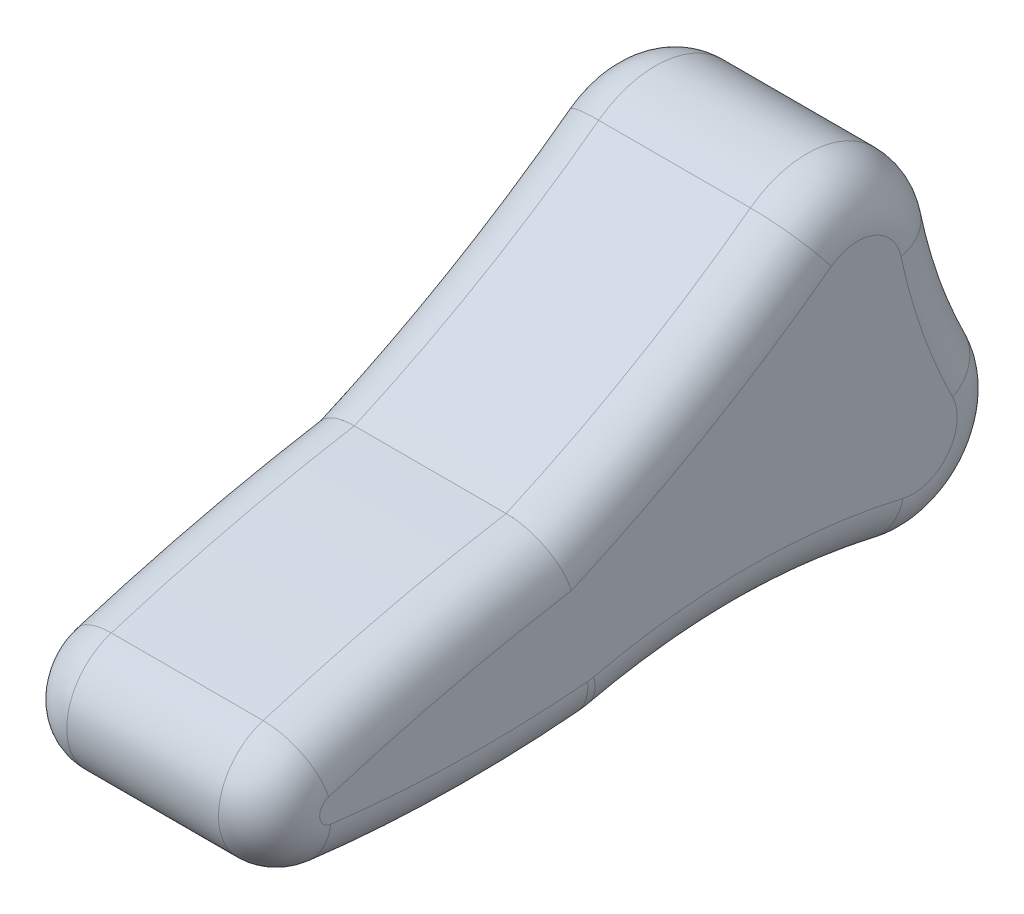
ISO-10303-21;
HEADER;
FILE_DESCRIPTION(('STEP AP214'),'2;1');
FILE_NAME('part.step','',(''),(''),'','','');
FILE_SCHEMA(('AUTOMOTIVE_DESIGN { 1 0 10303 214 1 1 1 1 }'));
ENDSEC;
DATA;
#1=APPLICATION_CONTEXT('core data for automotive mechanical design processes');
#2=APPLICATION_PROTOCOL_DEFINITION('international standard','automotive_design',2000,#1);
#3=PRODUCT_CONTEXT('',#1,'mechanical');
#4=PRODUCT('Part','Part','',(#3));
#5=PRODUCT_RELATED_PRODUCT_CATEGORY('part','',(#4));
#6=PRODUCT_DEFINITION_FORMATION('','',#4);
#7=PRODUCT_DEFINITION_CONTEXT('part definition',#1,'design');
#8=PRODUCT_DEFINITION('design','',#6,#7);
#9=PRODUCT_DEFINITION_SHAPE('','',#8);
#10=(LENGTH_UNIT() NAMED_UNIT(*) SI_UNIT(.MILLI.,.METRE.));
#11=(NAMED_UNIT(*) PLANE_ANGLE_UNIT() SI_UNIT($,.RADIAN.));
#12=(NAMED_UNIT(*) SI_UNIT($,.STERADIAN.) SOLID_ANGLE_UNIT());
#13=UNCERTAINTY_MEASURE_WITH_UNIT(LENGTH_MEASURE(1.E-05),#10,'distance_accuracy_value','');
#14=(GEOMETRIC_REPRESENTATION_CONTEXT(3) GLOBAL_UNCERTAINTY_ASSIGNED_CONTEXT((#13)) GLOBAL_UNIT_ASSIGNED_CONTEXT((#10,
#11,#12)) REPRESENTATION_CONTEXT('',''));
#15=CARTESIAN_POINT('',(0.,0.,0.));
#16=DIRECTION('',(0.,0.,1.));
#17=DIRECTION('',(1.,0.,0.));
#18=AXIS2_PLACEMENT_3D('',#15,#16,#17);
#19=CARTESIAN_POINT('',(165.1,-721.036665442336,300.274692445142));
#20=DIRECTION('',(-1.,0.,0.));
#21=DIRECTION('',(0.,0.,1.));
#22=AXIS2_PLACEMENT_3D('',#19,#20,#21);
#23=CYLINDRICAL_SURFACE('',#22,508.);
#24=DIRECTION('',(-1.,0.,0.));
#25=VECTOR('',#24,1.);
#26=CARTESIAN_POINT('',(114.3,-1185.70392378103,94.9740859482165));
#27=LINE('',#26,#25);
#28=CARTESIAN_POINT('',(144.78,-1185.70392378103,94.9740859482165));
#29=VERTEX_POINT('',#28);
#30=CARTESIAN_POINT('',(83.82,-1185.70392378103,94.9740859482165));
#31=VERTEX_POINT('',#30);
#32=EDGE_CURVE('E367',#29,#31,#27,.T.);
#33=ORIENTED_EDGE('',*,*,#32,.F.);
#34=CARTESIAN_POINT('',(144.78,-721.036665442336,300.274692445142));
#35=DIRECTION('',(-1.,0.,0.));
#36=DIRECTION('',(0.,0.,1.));
#37=AXIS2_PLACEMENT_3D('',#34,#35,#36);
#38=CIRCLE('',#37,508.);
#39=CARTESIAN_POINT('',(144.78,-1128.45838360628,-3.15823847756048));
#40=VERTEX_POINT('',#39);
#41=EDGE_CURVE('E220',#29,#40,#38,.F.);
#42=ORIENTED_EDGE('',*,*,#41,.T.);
#43=DIRECTION('',(-1.,0.,0.));
#44=VECTOR('',#43,1.);
#45=CARTESIAN_POINT('',(165.1,-1128.45838360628,-3.15823847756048));
#46=LINE('',#45,#44);
#47=CARTESIAN_POINT('',(83.82,-1128.45838360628,-3.15823847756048));
#48=VERTEX_POINT('',#47);
#49=EDGE_CURVE('E339',#40,#48,#46,.T.);
#50=ORIENTED_EDGE('',*,*,#49,.T.);
#51=CARTESIAN_POINT('',(83.82,-721.036665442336,300.274692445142));
#52=DIRECTION('',(-1.,0.,0.));
#53=DIRECTION('',(0.,0.,1.));
#54=AXIS2_PLACEMENT_3D('',#51,#52,#53);
#55=CIRCLE('',#54,508.);
#56=EDGE_CURVE('E218',#48,#31,#55,.T.);
#57=ORIENTED_EDGE('',*,*,#56,.T.);
#58=EDGE_LOOP('',(#33,#42,#50,#57));
#59=FACE_BOUND('',#58,.T.);
#60=ADVANCED_FACE('F30',(#59),#23,.F.);
#61=CARTESIAN_POINT('',(165.1,-1103.40350261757,-286.75330139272));
#62=DIRECTION('',(-1.,0.,0.));
#63=DIRECTION('',(0.,0.,1.));
#64=AXIS2_PLACEMENT_3D('',#61,#62,#63);
#65=CYLINDRICAL_SURFACE('',#64,228.6);
#66=DIRECTION('',(-1.,0.,0.));
#67=VECTOR('',#66,1.);
#68=CARTESIAN_POINT('',(165.1,-1151.07051106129,-63.1782215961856));
#69=LINE('',#68,#67);
#70=CARTESIAN_POINT('',(144.78,-1151.07051106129,-63.1782215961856));
#71=VERTEX_POINT('',#70);
#72=CARTESIAN_POINT('',(83.82,-1151.07051106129,-63.1782215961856));
#73=VERTEX_POINT('',#72);
#74=EDGE_CURVE('E175',#71,#73,#69,.T.);
#75=ORIENTED_EDGE('',*,*,#74,.F.);
#76=CARTESIAN_POINT('',(144.78,-1103.40350261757,-286.75330139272));
#77=DIRECTION('',(-1.,0.,0.));
#78=DIRECTION('',(0.,0.,1.));
#79=AXIS2_PLACEMENT_3D('',#76,#77,#78);
#80=CIRCLE('',#79,228.6);
#81=CARTESIAN_POINT('',(144.78,-1205.49908248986,-82.2185792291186));
#82=VERTEX_POINT('',#81);
#83=EDGE_CURVE('E191',#71,#82,#80,.F.);
#84=ORIENTED_EDGE('',*,*,#83,.T.);
#85=DIRECTION('',(-1.,0.,0.));
#86=VECTOR('',#85,1.);
#87=CARTESIAN_POINT('',(165.1,-1205.49908248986,-82.2185792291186));
#88=LINE('',#87,#86);
#89=CARTESIAN_POINT('',(83.82,-1205.49908248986,-82.2185792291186));
#90=VERTEX_POINT('',#89);
#91=EDGE_CURVE('E334',#82,#90,#88,.T.);
#92=ORIENTED_EDGE('',*,*,#91,.T.);
#93=CARTESIAN_POINT('',(83.82,-1103.40350261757,-286.75330139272));
#94=DIRECTION('',(-1.,0.,0.));
#95=DIRECTION('',(0.,0.,1.));
#96=AXIS2_PLACEMENT_3D('',#93,#94,#95);
#97=CIRCLE('',#96,228.6);
#98=EDGE_CURVE('E189',#90,#73,#97,.T.);
#99=ORIENTED_EDGE('',*,*,#98,.T.);
#100=EDGE_LOOP('',(#75,#84,#92,#99));
#101=FACE_BOUND('',#100,.T.);
#102=ADVANCED_FACE('F332',(#101),#65,.F.);
#103=CARTESIAN_POINT('',(165.1,-1159.01501246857,-25.9157082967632));
#104=DIRECTION('',(-1.,0.,0.));
#105=DIRECTION('',(0.,0.,1.));
#106=AXIS2_PLACEMENT_3D('',#103,#104,#105);
#107=CYLINDRICAL_SURFACE('',#106,38.1);
#108=ORIENTED_EDGE('',*,*,#49,.F.);
#109=CARTESIAN_POINT('',(144.78,-1159.01501246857,-25.9157082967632));
#110=DIRECTION('',(-1.,0.,0.));
#111=DIRECTION('',(0.,0.,1.));
#112=AXIS2_PLACEMENT_3D('',#109,#110,#111);
#113=CIRCLE('',#112,38.1);
#114=EDGE_CURVE('E162',#40,#71,#113,.T.);
#115=ORIENTED_EDGE('',*,*,#114,.T.);
#116=ORIENTED_EDGE('',*,*,#74,.T.);
#117=CARTESIAN_POINT('',(83.82,-1159.01501246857,-25.9157082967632));
#118=DIRECTION('',(-1.,0.,0.));
#119=DIRECTION('',(0.,0.,1.));
#120=AXIS2_PLACEMENT_3D('',#117,#118,#119);
#121=CIRCLE('',#120,38.1);
#122=EDGE_CURVE('E181',#73,#48,#121,.F.);
#123=ORIENTED_EDGE('',*,*,#122,.T.);
#124=EDGE_LOOP('',(#108,#115,#116,#123));
#125=FACE_BOUND('',#124,.T.);
#126=ADVANCED_FACE('F337',(#125),#107,.T.);
#127=CARTESIAN_POINT('',(165.1,-1222.51501246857,84.0695179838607));
#128=DIRECTION('',(-1.,0.,0.));
#129=DIRECTION('',(0.,0.,1.));
#130=AXIS2_PLACEMENT_3D('',#127,#128,#129);
#131=CYLINDRICAL_SURFACE('',#130,38.1000000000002);
#132=DIRECTION('',(-1.,0.,0.));
#133=VECTOR('',#132,1.);
#134=CARTESIAN_POINT('',(165.1,-1259.62669209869,75.4478455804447));
#135=LINE('',#134,#133);
#136=CARTESIAN_POINT('',(144.78,-1259.62669209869,75.4478455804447));
#137=VERTEX_POINT('',#136);
#138=CARTESIAN_POINT('',(83.82,-1259.62669209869,75.4478455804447));
#139=VERTEX_POINT('',#138);
#140=EDGE_CURVE('E341',#137,#139,#135,.T.);
#141=ORIENTED_EDGE('',*,*,#140,.F.);
#142=CARTESIAN_POINT('',(144.78,-1222.51501246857,84.0695179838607));
#143=DIRECTION('',(-1.,0.,0.));
#144=DIRECTION('',(0.,0.,1.));
#145=AXIS2_PLACEMENT_3D('',#142,#143,#144);
#146=CIRCLE('',#145,38.1000000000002);
#147=CARTESIAN_POINT('',(144.78,-1260.4716735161,80.7677181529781));
#148=VERTEX_POINT('',#147);
#149=EDGE_CURVE('E203',#137,#148,#146,.T.);
#150=ORIENTED_EDGE('',*,*,#149,.T.);
#151=DIRECTION('',(-1.,0.,0.));
#152=VECTOR('',#151,1.);
#153=CARTESIAN_POINT('',(165.1,-1260.4716735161,80.7677181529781));
#154=LINE('',#153,#152);
#155=CARTESIAN_POINT('',(83.82,-1260.4716735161,80.7677181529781));
#156=VERTEX_POINT('',#155);
#157=EDGE_CURVE('E398',#148,#156,#154,.T.);
#158=ORIENTED_EDGE('',*,*,#157,.T.);
#159=CARTESIAN_POINT('',(83.82,-1222.51501246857,84.0695179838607));
#160=DIRECTION('',(-1.,0.,0.));
#161=DIRECTION('',(0.,0.,1.));
#162=AXIS2_PLACEMENT_3D('',#159,#160,#161);
#163=CIRCLE('',#162,38.1000000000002);
#164=EDGE_CURVE('E201',#156,#139,#163,.F.);
#165=ORIENTED_EDGE('',*,*,#164,.T.);
#166=EDGE_LOOP('',(#141,#150,#158,#165));
#167=FACE_BOUND('',#166,.T.);
#168=ADVANCED_FACE('F420',(#167),#131,.T.);
#169=CARTESIAN_POINT('',(165.1,-1507.03788963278,17.9700295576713));
#170=DIRECTION('',(-1.,0.,0.));
#171=DIRECTION('',(0.,0.,1.));
#172=AXIS2_PLACEMENT_3D('',#169,#170,#171);
#173=CYLINDRICAL_SURFACE('',#172,254.);
#174=DIRECTION('',(-1.,0.,0.));
#175=VECTOR('',#174,1.);
#176=CARTESIAN_POINT('',(165.1,-1259.62669209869,-39.5077864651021));
#177=LINE('',#176,#175);
#178=CARTESIAN_POINT('',(144.78,-1259.62669209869,-39.5077864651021));
#179=VERTEX_POINT('',#178);
#180=CARTESIAN_POINT('',(83.82,-1259.62669209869,-39.5077864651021));
#181=VERTEX_POINT('',#180);
#182=EDGE_CURVE('E366',#179,#181,#177,.T.);
#183=ORIENTED_EDGE('',*,*,#182,.F.);
#184=CARTESIAN_POINT('',(144.78,-1507.03788963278,17.9700295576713));
#185=DIRECTION('',(-1.,0.,0.));
#186=DIRECTION('',(0.,0.,1.));
#187=AXIS2_PLACEMENT_3D('',#184,#185,#186);
#188=CIRCLE('',#187,254.);
#189=EDGE_CURVE('E199',#179,#137,#188,.F.);
#190=ORIENTED_EDGE('',*,*,#189,.T.);
#191=ORIENTED_EDGE('',*,*,#140,.T.);
#192=CARTESIAN_POINT('',(83.82,-1507.03788963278,17.9700295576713));
#193=DIRECTION('',(-1.,0.,0.));
#194=DIRECTION('',(0.,0.,1.));
#195=AXIS2_PLACEMENT_3D('',#192,#193,#194);
#196=CIRCLE('',#195,254.);
#197=EDGE_CURVE('E197',#139,#181,#196,.T.);
#198=ORIENTED_EDGE('',*,*,#197,.T.);
#199=EDGE_LOOP('',(#183,#190,#191,#198));
#200=FACE_BOUND('',#199,.T.);
#201=ADVANCED_FACE('F378',(#200),#173,.F.);
#202=CARTESIAN_POINT('',(165.1,-1222.51501246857,-48.1294588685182));
#203=DIRECTION('',(-1.,0.,0.));
#204=DIRECTION('',(0.,0.,1.));
#205=AXIS2_PLACEMENT_3D('',#202,#203,#204);
#206=CYLINDRICAL_SURFACE('',#205,38.1000000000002);
#207=ORIENTED_EDGE('',*,*,#91,.F.);
#208=CARTESIAN_POINT('',(144.78,-1222.51501246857,-48.1294588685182));
#209=DIRECTION('',(-1.,0.,0.));
#210=DIRECTION('',(0.,0.,1.));
#211=AXIS2_PLACEMENT_3D('',#208,#209,#210);
#212=CIRCLE('',#211,38.1000000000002);
#213=EDGE_CURVE('E195',#82,#179,#212,.T.);
#214=ORIENTED_EDGE('',*,*,#213,.T.);
#215=ORIENTED_EDGE('',*,*,#182,.T.);
#216=CARTESIAN_POINT('',(83.82,-1222.51501246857,-48.1294588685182));
#217=DIRECTION('',(-1.,0.,0.));
#218=DIRECTION('',(0.,0.,1.));
#219=AXIS2_PLACEMENT_3D('',#216,#217,#218);
#220=CIRCLE('',#219,38.1000000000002);
#221=EDGE_CURVE('E193',#181,#90,#220,.F.);
#222=ORIENTED_EDGE('',*,*,#221,.T.);
#223=EDGE_LOOP('',(#207,#214,#215,#222));
#224=FACE_BOUND('',#223,.T.);
#225=ADVANCED_FACE('F363',(#224),#206,.T.);
#226=CARTESIAN_POINT('',(165.1,-1131.20925754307,-156.334504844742));
#227=DIRECTION('',(-1.,0.,0.));
#228=DIRECTION('',(0.,0.,1.));
#229=AXIS2_PLACEMENT_3D('',#226,#227,#228);
#230=PLANE('',#229);
#231=CARTESIAN_POINT('',(165.1,-1103.40350261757,-286.75330139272));
#232=DIRECTION('',(-1.,0.,0.));
#233=DIRECTION('',(0.,0.,1.));
#234=AXIS2_PLACEMENT_3D('',#231,#232,#233);
#235=CIRCLE('',#234,248.92);
#236=CARTESIAN_POINT('',(165.1,-1214.57424514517,-64.0377150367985));
#237=VERTEX_POINT('',#236);
#238=CARTESIAN_POINT('',(165.1,-1155.30757847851,-43.304881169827));
#239=VERTEX_POINT('',#238);
#240=EDGE_CURVE('E179',#237,#239,#235,.T.);
#241=ORIENTED_EDGE('',*,*,#240,.T.);
#242=CARTESIAN_POINT('',(165.1,-1159.01501246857,-25.9157082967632));
#243=DIRECTION('',(-1.,0.,0.));
#244=DIRECTION('',(0.,0.,1.));
#245=AXIS2_PLACEMENT_3D('',#242,#243,#244);
#246=CIRCLE('',#245,17.78);
#247=CARTESIAN_POINT('',(165.1,-1144.75525233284,-15.2955557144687));
#248=VERTEX_POINT('',#247);
#249=EDGE_CURVE('E160',#239,#248,#246,.F.);
#250=ORIENTED_EDGE('',*,*,#249,.T.);
#251=CARTESIAN_POINT('',(165.1,-721.036665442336,300.274692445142));
#252=DIRECTION('',(-1.,0.,0.));
#253=DIRECTION('',(0.,0.,1.));
#254=AXIS2_PLACEMENT_3D('',#251,#252,#253);
#255=CIRCLE('',#254,528.32);
#256=CARTESIAN_POINT('',(165.1,-1205.32684173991,89.1229755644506));
#257=VERTEX_POINT('',#256);
#258=EDGE_CURVE('E168',#248,#257,#255,.T.);
#259=ORIENTED_EDGE('',*,*,#258,.T.);
#260=CARTESIAN_POINT('',(165.1,-1937.01800195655,-32.1917739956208));
#261=DIRECTION('',(-1.,0.,0.));
#262=DIRECTION('',(0.,0.,1.));
#263=AXIS2_PLACEMENT_3D('',#260,#261,#262);
#264=CIRCLE('',#263,741.68);
#265=CARTESIAN_POINT('',(165.1,-1228.34510342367,186.604810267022));
#266=VERTEX_POINT('',#265);
#267=EDGE_CURVE('E174',#257,#266,#264,.F.);
#268=ORIENTED_EDGE('',*,*,#267,.T.);
#269=CARTESIAN_POINT('',(165.1,-1233.19902738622,185.106203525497));
#270=DIRECTION('',(-1.,0.,0.));
#271=DIRECTION('',(0.,0.,1.));
#272=AXIS2_PLACEMENT_3D('',#269,#270,#271);
#273=CIRCLE('',#272,5.07999999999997);
#274=CARTESIAN_POINT('',(165.1,-1238.23919757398,185.741092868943));
#275=VERTEX_POINT('',#274);
#276=EDGE_CURVE('E346',#266,#275,#273,.F.);
#277=ORIENTED_EDGE('',*,*,#276,.T.);
#278=CARTESIAN_POINT('',(165.1,-754.382859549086,124.791715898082));
#279=DIRECTION('',(-1.,0.,0.));
#280=DIRECTION('',(0.,0.,1.));
#281=AXIS2_PLACEMENT_3D('',#278,#279,#280);
#282=CIRCLE('',#281,487.68);
#283=CARTESIAN_POINT('',(165.1,-1240.22812095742,82.5286780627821));
#284=VERTEX_POINT('',#283);
#285=EDGE_CURVE('E348',#275,#284,#282,.F.);
#286=ORIENTED_EDGE('',*,*,#285,.T.);
#287=CARTESIAN_POINT('',(165.1,-1222.51501246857,84.0695179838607));
#288=DIRECTION('',(-1.,0.,0.));
#289=DIRECTION('',(0.,0.,1.));
#290=AXIS2_PLACEMENT_3D('',#287,#288,#289);
#291=CIRCLE('',#290,17.7800000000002);
#292=CARTESIAN_POINT('',(165.1,-1239.83379629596,80.0460708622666));
#293=VERTEX_POINT('',#292);
#294=EDGE_CURVE('E350',#284,#293,#291,.F.);
#295=ORIENTED_EDGE('',*,*,#294,.T.);
#296=CARTESIAN_POINT('',(165.1,-1507.03788963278,17.9700295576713));
#297=DIRECTION('',(-1.,0.,0.));
#298=DIRECTION('',(0.,0.,1.));
#299=AXIS2_PLACEMENT_3D('',#296,#297,#298);
#300=CIRCLE('',#299,274.32);
#301=CARTESIAN_POINT('',(165.1,-1239.83379629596,-44.106011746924));
#302=VERTEX_POINT('',#301);
#303=EDGE_CURVE('E352',#293,#302,#300,.T.);
#304=ORIENTED_EDGE('',*,*,#303,.T.);
#305=CARTESIAN_POINT('',(165.1,-1222.51501246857,-48.1294588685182));
#306=DIRECTION('',(-1.,0.,0.));
#307=DIRECTION('',(0.,0.,1.));
#308=AXIS2_PLACEMENT_3D('',#305,#306,#307);
#309=CIRCLE('',#308,17.7800000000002);
#310=EDGE_CURVE('E184',#302,#237,#309,.F.);
#311=ORIENTED_EDGE('',*,*,#310,.T.);
#312=EDGE_LOOP('',(#241,#250,#259,#268,#277,#286,#295,#304,#311));
#313=FACE_BOUND('',#312,.T.);
#314=ADVANCED_FACE('F177',(#313),#230,.F.);
#315=CARTESIAN_POINT('',(63.5,-1131.20925754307,-156.334504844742));
#316=DIRECTION('',(-1.,0.,0.));
#317=DIRECTION('',(0.,0.,1.));
#318=AXIS2_PLACEMENT_3D('',#315,#316,#317);
#319=PLANE('',#318);
#320=CARTESIAN_POINT('',(63.5,-754.382859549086,124.791715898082));
#321=DIRECTION('',(-1.,0.,0.));
#322=DIRECTION('',(0.,0.,1.));
#323=AXIS2_PLACEMENT_3D('',#320,#321,#322);
#324=CIRCLE('',#323,487.68);
#325=CARTESIAN_POINT('',(63.5,-1240.22812095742,82.5286780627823));
#326=VERTEX_POINT('',#325);
#327=CARTESIAN_POINT('',(63.5,-1238.23919757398,185.741092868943));
#328=VERTEX_POINT('',#327);
#329=EDGE_CURVE('E39',#326,#328,#324,.T.);
#330=ORIENTED_EDGE('',*,*,#329,.T.);
#331=CARTESIAN_POINT('',(63.5,-1233.19902738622,185.106203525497));
#332=DIRECTION('',(-1.,0.,0.));
#333=DIRECTION('',(0.,0.,1.));
#334=AXIS2_PLACEMENT_3D('',#331,#332,#333);
#335=CIRCLE('',#334,5.07999999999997);
#336=CARTESIAN_POINT('',(63.5,-1228.34510342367,186.604810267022));
#337=VERTEX_POINT('',#336);
#338=EDGE_CURVE('E11',#328,#337,#335,.T.);
#339=ORIENTED_EDGE('',*,*,#338,.T.);
#340=CARTESIAN_POINT('',(63.5,-1937.01800195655,-32.1917739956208));
#341=DIRECTION('',(-1.,0.,0.));
#342=DIRECTION('',(0.,0.,1.));
#343=AXIS2_PLACEMENT_3D('',#340,#341,#342);
#344=CIRCLE('',#343,741.68);
#345=CARTESIAN_POINT('',(63.5,-1205.32684173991,89.1229755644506));
#346=VERTEX_POINT('',#345);
#347=EDGE_CURVE('E222',#337,#346,#344,.T.);
#348=ORIENTED_EDGE('',*,*,#347,.T.);
#349=CARTESIAN_POINT('',(63.5,-721.036665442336,300.274692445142));
#350=DIRECTION('',(-1.,0.,0.));
#351=DIRECTION('',(0.,0.,1.));
#352=AXIS2_PLACEMENT_3D('',#349,#350,#351);
#353=CIRCLE('',#352,528.32);
#354=CARTESIAN_POINT('',(63.5,-1144.75525233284,-15.2955557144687));
#355=VERTEX_POINT('',#354);
#356=EDGE_CURVE('E224',#346,#355,#353,.F.);
#357=ORIENTED_EDGE('',*,*,#356,.T.);
#358=CARTESIAN_POINT('',(63.5,-1159.01501246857,-25.9157082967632));
#359=DIRECTION('',(-1.,0.,0.));
#360=DIRECTION('',(0.,0.,1.));
#361=AXIS2_PLACEMENT_3D('',#358,#359,#360);
#362=CIRCLE('',#361,17.78);
#363=CARTESIAN_POINT('',(63.5,-1155.30757847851,-43.304881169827));
#364=VERTEX_POINT('',#363);
#365=EDGE_CURVE('E226',#355,#364,#362,.T.);
#366=ORIENTED_EDGE('',*,*,#365,.T.);
#367=CARTESIAN_POINT('',(63.5,-1103.40350261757,-286.75330139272));
#368=DIRECTION('',(-1.,0.,0.));
#369=DIRECTION('',(0.,0.,1.));
#370=AXIS2_PLACEMENT_3D('',#367,#368,#369);
#371=CIRCLE('',#370,248.92);
#372=CARTESIAN_POINT('',(63.5,-1214.57424514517,-64.0377150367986));
#373=VERTEX_POINT('',#372);
#374=EDGE_CURVE('E228',#364,#373,#371,.F.);
#375=ORIENTED_EDGE('',*,*,#374,.T.);
#376=CARTESIAN_POINT('',(63.5,-1222.51501246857,-48.1294588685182));
#377=DIRECTION('',(-1.,0.,0.));
#378=DIRECTION('',(0.,0.,1.));
#379=AXIS2_PLACEMENT_3D('',#376,#377,#378);
#380=CIRCLE('',#379,17.7800000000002);
#381=CARTESIAN_POINT('',(63.5,-1239.83379629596,-44.106011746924));
#382=VERTEX_POINT('',#381);
#383=EDGE_CURVE('E230',#373,#382,#380,.T.);
#384=ORIENTED_EDGE('',*,*,#383,.T.);
#385=CARTESIAN_POINT('',(63.5,-1507.03788963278,17.9700295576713));
#386=DIRECTION('',(-1.,0.,0.));
#387=DIRECTION('',(0.,0.,1.));
#388=AXIS2_PLACEMENT_3D('',#385,#386,#387);
#389=CIRCLE('',#388,274.32);
#390=CARTESIAN_POINT('',(63.5,-1239.83379629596,80.0460708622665));
#391=VERTEX_POINT('',#390);
#392=EDGE_CURVE('E232',#382,#391,#389,.F.);
#393=ORIENTED_EDGE('',*,*,#392,.T.);
#394=CARTESIAN_POINT('',(63.5,-1222.51501246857,84.0695179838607));
#395=DIRECTION('',(-1.,0.,0.));
#396=DIRECTION('',(0.,0.,1.));
#397=AXIS2_PLACEMENT_3D('',#394,#395,#396);
#398=CIRCLE('',#397,17.7800000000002);
#399=EDGE_CURVE('E50',#391,#326,#398,.T.);
#400=ORIENTED_EDGE('',*,*,#399,.T.);
#401=EDGE_LOOP('',(#330,#339,#348,#357,#366,#375,#384,#393,#400));
#402=FACE_BOUND('',#401,.T.);
#403=ADVANCED_FACE('F436',(#402),#319,.T.);
#404=CARTESIAN_POINT('',(165.1,-1937.01800195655,-32.1917739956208));
#405=DIRECTION('',(-1.,0.,0.));
#406=DIRECTION('',(0.,0.,1.));
#407=AXIS2_PLACEMENT_3D('',#404,#405,#406);
#408=CYLINDRICAL_SURFACE('',#407,762.);
#409=DIRECTION('',(-1.,0.,0.));
#410=VECTOR('',#409,1.);
#411=CARTESIAN_POINT('',(165.1,-1208.92940757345,192.599237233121));
#412=LINE('',#411,#410);
#413=CARTESIAN_POINT('',(144.78,-1208.92940757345,192.599237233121));
#414=VERTEX_POINT('',#413);
#415=CARTESIAN_POINT('',(83.82,-1208.92940757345,192.599237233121));
#416=VERTEX_POINT('',#415);
#417=EDGE_CURVE('E371',#414,#416,#412,.T.);
#418=ORIENTED_EDGE('',*,*,#417,.F.);
#419=CARTESIAN_POINT('',(144.78,-1937.01800195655,-32.1917739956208));
#420=DIRECTION('',(-1.,0.,0.));
#421=DIRECTION('',(0.,0.,1.));
#422=AXIS2_PLACEMENT_3D('',#419,#420,#421);
#423=CIRCLE('',#422,762.);
#424=EDGE_CURVE('E216',#414,#29,#423,.T.);
#425=ORIENTED_EDGE('',*,*,#424,.T.);
#426=ORIENTED_EDGE('',*,*,#32,.T.);
#427=CARTESIAN_POINT('',(83.82,-1937.01800195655,-32.1917739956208));
#428=DIRECTION('',(-1.,0.,0.));
#429=DIRECTION('',(0.,0.,1.));
#430=AXIS2_PLACEMENT_3D('',#427,#428,#429);
#431=CIRCLE('',#430,762.);
#432=EDGE_CURVE('E214',#31,#416,#431,.F.);
#433=ORIENTED_EDGE('',*,*,#432,.T.);
#434=EDGE_LOOP('',(#418,#425,#426,#433));
#435=FACE_BOUND('',#434,.T.);
#436=ADVANCED_FACE('F577',(#435),#408,.T.);
#437=CARTESIAN_POINT('',(165.1,-1233.19902738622,185.106203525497));
#438=DIRECTION('',(-1.,0.,0.));
#439=DIRECTION('',(0.,0.,1.));
#440=AXIS2_PLACEMENT_3D('',#437,#438,#439);
#441=CYLINDRICAL_SURFACE('',#440,25.4);
#442=DIRECTION('',(-1.,0.,0.));
#443=VECTOR('',#442,1.);
#444=CARTESIAN_POINT('',(165.1,-1258.39987832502,188.280650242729));
#445=LINE('',#444,#443);
#446=CARTESIAN_POINT('',(144.78,-1258.39987832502,188.280650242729));
#447=VERTEX_POINT('',#446);
#448=CARTESIAN_POINT('',(83.82,-1258.39987832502,188.280650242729));
#449=VERTEX_POINT('',#448);
#450=EDGE_CURVE('E424',#447,#449,#445,.T.);
#451=ORIENTED_EDGE('',*,*,#450,.F.);
#452=CARTESIAN_POINT('',(144.78,-1233.19902738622,185.106203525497));
#453=DIRECTION('',(-1.,0.,0.));
#454=DIRECTION('',(0.,0.,1.));
#455=AXIS2_PLACEMENT_3D('',#452,#453,#454);
#456=CIRCLE('',#455,25.4);
#457=EDGE_CURVE('E212',#447,#414,#456,.T.);
#458=ORIENTED_EDGE('',*,*,#457,.T.);
#459=ORIENTED_EDGE('',*,*,#417,.T.);
#460=CARTESIAN_POINT('',(83.82,-1233.19902738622,185.106203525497));
#461=DIRECTION('',(-1.,0.,0.));
#462=DIRECTION('',(0.,0.,1.));
#463=AXIS2_PLACEMENT_3D('',#460,#461,#462);
#464=CIRCLE('',#463,25.4);
#465=EDGE_CURVE('E209',#416,#449,#464,.F.);
#466=ORIENTED_EDGE('',*,*,#465,.T.);
#467=EDGE_LOOP('',(#451,#458,#459,#466));
#468=FACE_BOUND('',#467,.T.);
#469=ADVANCED_FACE('F431',(#468),#441,.T.);
#470=CARTESIAN_POINT('',(165.1,-754.382859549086,124.791715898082));
#471=DIRECTION('',(-1.,0.,0.));
#472=DIRECTION('',(0.,0.,1.));
#473=AXIS2_PLACEMENT_3D('',#470,#471,#472);
#474=CYLINDRICAL_SURFACE('',#473,508.);
#475=ORIENTED_EDGE('',*,*,#157,.F.);
#476=CARTESIAN_POINT('',(144.78,-754.382859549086,124.791715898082));
#477=DIRECTION('',(-1.,0.,0.));
#478=DIRECTION('',(0.,0.,1.));
#479=AXIS2_PLACEMENT_3D('',#476,#477,#478);
#480=CIRCLE('',#479,508.);
#481=EDGE_CURVE('E207',#148,#447,#480,.T.);
#482=ORIENTED_EDGE('',*,*,#481,.T.);
#483=ORIENTED_EDGE('',*,*,#450,.T.);
#484=CARTESIAN_POINT('',(83.82,-754.382859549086,124.791715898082));
#485=DIRECTION('',(-1.,0.,0.));
#486=DIRECTION('',(0.,0.,1.));
#487=AXIS2_PLACEMENT_3D('',#484,#485,#486);
#488=CIRCLE('',#487,508.);
#489=EDGE_CURVE('E205',#449,#156,#488,.F.);
#490=ORIENTED_EDGE('',*,*,#489,.T.);
#491=EDGE_LOOP('',(#475,#482,#483,#490));
#492=FACE_BOUND('',#491,.T.);
#493=ADVANCED_FACE('F274',(#492),#474,.T.);
#494=CARTESIAN_POINT('',(144.78,-1222.51501246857,84.0695179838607));
#495=DIRECTION('',(-1.,0.,0.));
#496=DIRECTION('',(0.,0.,1.));
#497=AXIS2_PLACEMENT_3D('',#494,#495,#496);
#498=DEGENERATE_TOROIDAL_SURFACE('',#497,17.7800000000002,20.32,.T.);
#499=CARTESIAN_POINT('',(144.78,-1239.83379629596,80.0460708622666));
#500=DIRECTION('',(0.,0.226290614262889,-0.974059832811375));
#501=DIRECTION('',(0.,0.974059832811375,0.226290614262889));
#502=AXIS2_PLACEMENT_3D('',#499,#500,#501);
#503=CIRCLE('',#502,20.32);
#504=EDGE_CURVE('E399',#293,#137,#503,.T.);
#505=ORIENTED_EDGE('',*,*,#504,.F.);
#506=ORIENTED_EDGE('',*,*,#294,.F.);
#507=CARTESIAN_POINT('',(144.78,-1240.22812095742,82.5286780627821));
#508=DIRECTION('',(0.,-0.0866614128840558,0.996237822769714));
#509=DIRECTION('',(0.,-0.996237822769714,-0.0866614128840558));
#510=AXIS2_PLACEMENT_3D('',#507,#508,#509);
#511=CIRCLE('',#510,20.32);
#512=EDGE_CURVE('E395',#148,#284,#511,.T.);
#513=ORIENTED_EDGE('',*,*,#512,.F.);
#514=ORIENTED_EDGE('',*,*,#149,.F.);
#515=EDGE_LOOP('',(#505,#506,#513,#514));
#516=FACE_BOUND('',#515,.T.);
#517=ADVANCED_FACE('F270',(#516),#498,.T.);
#518=CARTESIAN_POINT('',(144.78,-754.382859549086,124.791715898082));
#519=DIRECTION('',(-1.,0.,0.));
#520=DIRECTION('',(0.,0.,1.));
#521=AXIS2_PLACEMENT_3D('',#518,#519,#520);
#522=TOROIDAL_SURFACE('',#521,487.68,20.32);
#523=ORIENTED_EDGE('',*,*,#512,.T.);
#524=ORIENTED_EDGE('',*,*,#285,.F.);
#525=CARTESIAN_POINT('',(144.78,-1238.23919757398,185.741092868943));
#526=DIRECTION('',(0.,0.124978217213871,0.992159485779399));
#527=DIRECTION('',(0.,-0.9921594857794,0.124978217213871));
#528=AXIS2_PLACEMENT_3D('',#525,#526,#527);
#529=CIRCLE('',#528,20.32);
#530=EDGE_CURVE('E402',#447,#275,#529,.T.);
#531=ORIENTED_EDGE('',*,*,#530,.F.);
#532=ORIENTED_EDGE('',*,*,#481,.F.);
#533=EDGE_LOOP('',(#523,#524,#531,#532));
#534=FACE_BOUND('',#533,.T.);
#535=ADVANCED_FACE('F266',(#534),#522,.T.);
#536=CARTESIAN_POINT('',(144.78,-1507.03788963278,17.9700295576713));
#537=DIRECTION('',(-1.,0.,0.));
#538=DIRECTION('',(0.,0.,1.));
#539=AXIS2_PLACEMENT_3D('',#536,#537,#538);
#540=TOROIDAL_SURFACE('',#539,274.32,20.32);
#541=ORIENTED_EDGE('',*,*,#504,.T.);
#542=ORIENTED_EDGE('',*,*,#189,.F.);
#543=CARTESIAN_POINT('',(144.78,-1239.83379629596,-44.106011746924));
#544=DIRECTION('',(0.,-0.22629061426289,-0.974059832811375));
#545=DIRECTION('',(0.,0.974059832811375,-0.22629061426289));
#546=AXIS2_PLACEMENT_3D('',#543,#544,#545);
#547=CIRCLE('',#546,20.32);
#548=EDGE_CURVE('E405',#302,#179,#547,.T.);
#549=ORIENTED_EDGE('',*,*,#548,.F.);
#550=ORIENTED_EDGE('',*,*,#303,.F.);
#551=EDGE_LOOP('',(#541,#542,#549,#550));
#552=FACE_BOUND('',#551,.T.);
#553=ADVANCED_FACE('F262',(#552),#540,.T.);
#554=CARTESIAN_POINT('',(144.78,-1233.19902738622,185.106203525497));
#555=DIRECTION('',(-1.,0.,0.));
#556=DIRECTION('',(0.,0.,1.));
#557=AXIS2_PLACEMENT_3D('',#554,#555,#556);
#558=DEGENERATE_TOROIDAL_SURFACE('',#557,5.07999999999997,20.32,.T.);
#559=ORIENTED_EDGE('',*,*,#530,.T.);
#560=ORIENTED_EDGE('',*,*,#276,.F.);
#561=CARTESIAN_POINT('',(144.78,-1228.34510342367,186.604810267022));
#562=DIRECTION('',(0.,0.295001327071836,-0.955496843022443));
#563=DIRECTION('',(0.,0.955496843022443,0.295001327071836));
#564=AXIS2_PLACEMENT_3D('',#561,#562,#563);
#565=CIRCLE('',#564,20.32);
#566=EDGE_CURVE('E361',#414,#266,#565,.T.);
#567=ORIENTED_EDGE('',*,*,#566,.F.);
#568=ORIENTED_EDGE('',*,*,#457,.F.);
#569=EDGE_LOOP('',(#559,#560,#567,#568));
#570=FACE_BOUND('',#569,.T.);
#571=ADVANCED_FACE('F258',(#570),#558,.T.);
#572=CARTESIAN_POINT('',(144.78,-1222.51501246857,-48.1294588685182));
#573=DIRECTION('',(-1.,0.,0.));
#574=DIRECTION('',(0.,0.,1.));
#575=AXIS2_PLACEMENT_3D('',#572,#573,#574);
#576=DEGENERATE_TOROIDAL_SURFACE('',#575,17.7800000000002,20.32,.T.);
#577=ORIENTED_EDGE('',*,*,#548,.T.);
#578=ORIENTED_EDGE('',*,*,#213,.F.);
#579=CARTESIAN_POINT('',(144.78,-1214.57424514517,-64.0377150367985));
#580=DIRECTION('',(0.,0.894727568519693,0.446612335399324));
#581=DIRECTION('',(0.,-0.446612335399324,0.894727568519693));
#582=AXIS2_PLACEMENT_3D('',#579,#580,#581);
#583=CIRCLE('',#582,20.32);
#584=EDGE_CURVE('E243',#237,#82,#583,.T.);
#585=ORIENTED_EDGE('',*,*,#584,.F.);
#586=ORIENTED_EDGE('',*,*,#310,.F.);
#587=EDGE_LOOP('',(#577,#578,#585,#586));
#588=FACE_BOUND('',#587,.T.);
#589=ADVANCED_FACE('F255',(#588),#576,.T.);
#590=CARTESIAN_POINT('',(144.78,-1937.01800195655,-32.1917739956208));
#591=DIRECTION('',(-1.,0.,0.));
#592=DIRECTION('',(0.,0.,1.));
#593=AXIS2_PLACEMENT_3D('',#590,#591,#592);
#594=TOROIDAL_SURFACE('',#593,741.68,20.32);
#595=ORIENTED_EDGE('',*,*,#566,.T.);
#596=ORIENTED_EDGE('',*,*,#267,.F.);
#597=CARTESIAN_POINT('',(144.78,-1185.70392378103,94.9740859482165));
#598=CARTESIAN_POINT('',(145.064178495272,-1185.70392333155,94.974086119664));
#599=CARTESIAN_POINT('',(145.348325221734,-1185.70967812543,94.972357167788));
#600=CARTESIAN_POINT('',(145.916104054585,-1185.73268049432,94.9654466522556));
#601=CARTESIAN_POINT('',(146.199736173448,-1185.74992778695,94.9602651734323));
#602=CARTESIAN_POINT('',(147.049049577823,-1185.81886966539,94.9395540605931));
#603=CARTESIAN_POINT('',(147.613304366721,-1185.88776427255,94.9188577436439));
#604=CARTESIAN_POINT('',(148.733214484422,-1186.07084842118,94.8638655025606));
#605=CARTESIAN_POINT('',(149.288877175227,-1186.18499666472,94.8295819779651));
#606=CARTESIAN_POINT('',(150.113202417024,-1186.38949059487,94.7681751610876));
#607=CARTESIAN_POINT('',(150.386460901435,-1186.46320437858,94.7460414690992));
#608=CARTESIAN_POINT('',(150.929562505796,-1186.62161162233,94.6984819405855));
#609=CARTESIAN_POINT('',(151.199404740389,-1186.70630786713,94.6730552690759));
#610=CARTESIAN_POINT('',(152.003096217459,-1186.97666337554,94.5919007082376));
#611=CARTESIAN_POINT('',(152.53108373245,-1187.17858283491,94.5313002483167));
#612=CARTESIAN_POINT('',(153.567456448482,-1187.62424973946,94.3975835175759));
#613=CARTESIAN_POINT('',(154.075841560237,-1187.86799737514,94.3244671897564));
#614=CARTESIAN_POINT('',(154.820937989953,-1188.26356618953,94.2058484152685));
#615=CARTESIAN_POINT('',(155.066410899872,-1188.40042714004,94.164814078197));
#616=CARTESIAN_POINT('',(155.551082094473,-1188.68386114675,94.0798478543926));
#617=CARTESIAN_POINT('',(155.790281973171,-1188.83043170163,94.035916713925));
#618=CARTESIAN_POINT('',(156.497976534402,-1189.284401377,93.89987427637));
#619=CARTESIAN_POINT('',(156.956613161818,-1189.60608348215,93.803506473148));
#620=CARTESIAN_POINT('',(157.845630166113,-1190.28619443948,93.5998465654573));
#621=CARTESIAN_POINT('',(158.275910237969,-1190.64474333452,93.4925187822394));
#622=CARTESIAN_POINT('',(159.103617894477,-1191.3951295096,93.2680003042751));
#623=CARTESIAN_POINT('',(159.501045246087,-1191.78696702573,93.1508095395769));
#624=CARTESIAN_POINT('',(160.260469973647,-1192.60130988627,92.9073746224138));
#625=CARTESIAN_POINT('',(160.622456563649,-1193.02382449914,92.7811277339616));
#626=CARTESIAN_POINT('',(161.136786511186,-1193.6780817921,92.5857377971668));
#627=CARTESIAN_POINT('',(161.303460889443,-1193.89959099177,92.5196018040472));
#628=CARTESIAN_POINT('',(161.62706454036,-1194.34914543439,92.3854135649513));
#629=CARTESIAN_POINT('',(161.783991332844,-1194.5771923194,92.3173608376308));
#630=CARTESIAN_POINT('',(162.241889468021,-1195.27383217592,92.1095287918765));
#631=CARTESIAN_POINT('',(162.527525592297,-1195.7518047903,91.9670073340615));
#632=CARTESIAN_POINT('',(163.055984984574,-1196.72905455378,91.6757795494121));
#633=CARTESIAN_POINT('',(163.298808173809,-1197.22833174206,91.5270732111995));
#634=CARTESIAN_POINT('',(163.629639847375,-1197.99036867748,91.300240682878));
#635=CARTESIAN_POINT('',(163.734343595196,-1198.24654906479,91.2240065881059));
#636=CARTESIAN_POINT('',(163.932458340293,-1198.76282748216,91.0704184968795));
#637=CARTESIAN_POINT('',(164.025872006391,-1199.02292456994,90.993064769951));
#638=CARTESIAN_POINT('',(164.28893930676,-1199.80844017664,90.7595207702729));
#639=CARTESIAN_POINT('',(164.44149988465,-1200.33926887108,90.601792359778));
#640=CARTESIAN_POINT('',(164.657537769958,-1201.23556542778,90.33563592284));
#641=CARTESIAN_POINT('',(164.733826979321,-1201.59825773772,90.22797835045));
#642=CARTESIAN_POINT('',(164.865064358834,-1202.32720820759,90.0116957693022));
#643=CARTESIAN_POINT('',(164.920014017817,-1202.69346611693,89.9030708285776));
#644=CARTESIAN_POINT('',(165.008329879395,-1203.42777955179,89.6853800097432));
#645=CARTESIAN_POINT('',(165.041730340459,-1203.79583128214,89.5763151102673));
#646=CARTESIAN_POINT('',(165.08698374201,-1204.53311338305,89.3579286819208));
#647=CARTESIAN_POINT('',(165.098842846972,-1204.90234338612,89.2486072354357));
#648=CARTESIAN_POINT('',(165.099973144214,-1205.28997256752,89.1338867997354));
#649=CARTESIAN_POINT('',(165.10000001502,-1205.30840724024,89.1284310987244));
#650=CARTESIAN_POINT('',(165.1,-1205.32684173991,89.1229755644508));
#651=B_SPLINE_CURVE_WITH_KNOTS('',3,(#597,#598,#599,#600,#601,#602,#603,#604,#605,#606,#607,
#608,#609,#610,#611,#612,#613,#614,#615,#616,#617,#618,#619,#620,#621,#622,#623,#624,#625,#626,
#627,#628,#629,#630,#631,#632,#633,#634,#635,#636,#637,#638,#639,#640,#641,#642,#643,#644,#645,
#646,#647,#648,#649,#650),.UNSPECIFIED.,.F.,.F.,(4,2,2,2,2,2,2,2,2,2,2,2,2,2,2,2,2,2,2,2,2,2,2,
2,2,2,4),(0.,0.852408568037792,1.70479619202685,3.40910360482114,5.1118592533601,
5.96331019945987,6.81497746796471,8.51839386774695,10.2218180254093,11.0736810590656,
11.9253254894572,13.6284535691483,15.3373142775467,17.0461871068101,18.7555784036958,
19.610341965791,20.4653221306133,22.1874724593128,23.9096259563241,24.7705796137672,
25.6313293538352,27.352200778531,28.5095195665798,29.6667575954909,30.8221513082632,
31.9772143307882,32.0348893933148),.UNSPECIFIED.);
#652=EDGE_CURVE('E171',#29,#257,#651,.T.);
#653=ORIENTED_EDGE('',*,*,#652,.F.);
#654=ORIENTED_EDGE('',*,*,#424,.F.);
#655=EDGE_LOOP('',(#595,#596,#653,#654));
#656=FACE_BOUND('',#655,.T.);
#657=ADVANCED_FACE('F245',(#656),#594,.T.);
#658=CARTESIAN_POINT('',(144.78,-1103.40350261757,-286.75330139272));
#659=DIRECTION('',(-1.,0.,0.));
#660=DIRECTION('',(0.,0.,1.));
#661=AXIS2_PLACEMENT_3D('',#658,#659,#660);
#662=TOROIDAL_SURFACE('',#661,248.92,20.32);
#663=ORIENTED_EDGE('',*,*,#584,.T.);
#664=ORIENTED_EDGE('',*,*,#83,.F.);
#665=CARTESIAN_POINT('',(144.78,-1155.30757847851,-43.304881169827));
#666=DIRECTION('',(0.,0.978018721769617,0.208517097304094));
#667=DIRECTION('',(0.,-0.208517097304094,0.978018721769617));
#668=AXIS2_PLACEMENT_3D('',#665,#666,#667);
#669=CIRCLE('',#668,20.32);
#670=EDGE_CURVE('E165',#239,#71,#669,.T.);
#671=ORIENTED_EDGE('',*,*,#670,.F.);
#672=ORIENTED_EDGE('',*,*,#240,.F.);
#673=EDGE_LOOP('',(#663,#664,#671,#672));
#674=FACE_BOUND('',#673,.T.);
#675=ADVANCED_FACE('F251',(#674),#662,.T.);
#676=CARTESIAN_POINT('',(144.78,-721.036665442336,300.274692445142));
#677=DIRECTION('',(-1.,0.,0.));
#678=DIRECTION('',(0.,0.,1.));
#679=AXIS2_PLACEMENT_3D('',#676,#677,#678);
#680=TOROIDAL_SURFACE('',#679,528.32,20.32);
#681=ORIENTED_EDGE('',*,*,#652,.T.);
#682=ORIENTED_EDGE('',*,*,#258,.F.);
#683=CARTESIAN_POINT('',(144.78,-1144.75525233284,-15.2955557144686));
#684=DIRECTION('',(0.,0.597308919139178,-0.802011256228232));
#685=DIRECTION('',(0.,0.802011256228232,0.597308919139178));
#686=AXIS2_PLACEMENT_3D('',#683,#684,#685);
#687=CIRCLE('',#686,20.32);
#688=EDGE_CURVE('E156',#40,#248,#687,.T.);
#689=ORIENTED_EDGE('',*,*,#688,.F.);
#690=ORIENTED_EDGE('',*,*,#41,.F.);
#691=EDGE_LOOP('',(#681,#682,#689,#690));
#692=FACE_BOUND('',#691,.T.);
#693=ADVANCED_FACE('F169',(#692),#680,.T.);
#694=CARTESIAN_POINT('',(144.78,-1159.01501246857,-25.9157082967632));
#695=DIRECTION('',(-1.,0.,0.));
#696=DIRECTION('',(0.,0.,1.));
#697=AXIS2_PLACEMENT_3D('',#694,#695,#696);
#698=DEGENERATE_TOROIDAL_SURFACE('',#697,17.78,20.32,.T.);
#699=ORIENTED_EDGE('',*,*,#670,.T.);
#700=ORIENTED_EDGE('',*,*,#114,.F.);
#701=ORIENTED_EDGE('',*,*,#688,.T.);
#702=ORIENTED_EDGE('',*,*,#249,.F.);
#703=EDGE_LOOP('',(#699,#700,#701,#702));
#704=FACE_BOUND('',#703,.T.);
#705=ADVANCED_FACE('F158',(#704),#698,.T.);
#706=CARTESIAN_POINT('',(83.82,-1103.40350261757,-286.75330139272));
#707=DIRECTION('',(-1.,0.,0.));
#708=DIRECTION('',(0.,0.,1.));
#709=AXIS2_PLACEMENT_3D('',#706,#707,#708);
#710=TOROIDAL_SURFACE('',#709,248.92,20.32);
#711=CARTESIAN_POINT('',(83.82,-1155.30757847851,-43.304881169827));
#712=DIRECTION('',(0.,0.978018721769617,0.208517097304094));
#713=DIRECTION('',(0.,-0.208517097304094,0.978018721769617));
#714=AXIS2_PLACEMENT_3D('',#711,#712,#713);
#715=CIRCLE('',#714,20.32);
#716=EDGE_CURVE('E312',#73,#364,#715,.T.);
#717=ORIENTED_EDGE('',*,*,#716,.F.);
#718=ORIENTED_EDGE('',*,*,#98,.F.);
#719=CARTESIAN_POINT('',(83.82,-1214.57424514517,-64.0377150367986));
#720=DIRECTION('',(0.,-0.894727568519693,-0.446612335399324));
#721=DIRECTION('',(0.,0.446612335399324,-0.894727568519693));
#722=AXIS2_PLACEMENT_3D('',#719,#720,#721);
#723=CIRCLE('',#722,20.32);
#724=EDGE_CURVE('E34',#373,#90,#723,.T.);
#725=ORIENTED_EDGE('',*,*,#724,.F.);
#726=ORIENTED_EDGE('',*,*,#374,.F.);
#727=EDGE_LOOP('',(#717,#718,#725,#726));
#728=FACE_BOUND('',#727,.T.);
#729=ADVANCED_FACE('F32',(#728),#710,.T.);
#730=CARTESIAN_POINT('',(83.82,-1222.51501246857,-48.1294588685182));
#731=DIRECTION('',(-1.,0.,0.));
#732=DIRECTION('',(0.,0.,1.));
#733=AXIS2_PLACEMENT_3D('',#730,#731,#732);
#734=DEGENERATE_TOROIDAL_SURFACE('',#733,17.7800000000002,20.32,.T.);
#735=ORIENTED_EDGE('',*,*,#724,.T.);
#736=ORIENTED_EDGE('',*,*,#221,.F.);
#737=CARTESIAN_POINT('',(83.82,-1239.83379629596,-44.106011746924));
#738=DIRECTION('',(0.,0.226290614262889,0.974059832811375));
#739=DIRECTION('',(0.,-0.974059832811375,0.226290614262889));
#740=AXIS2_PLACEMENT_3D('',#737,#738,#739);
#741=CIRCLE('',#740,20.32);
#742=EDGE_CURVE('E310',#382,#181,#741,.T.);
#743=ORIENTED_EDGE('',*,*,#742,.F.);
#744=ORIENTED_EDGE('',*,*,#383,.F.);
#745=EDGE_LOOP('',(#735,#736,#743,#744));
#746=FACE_BOUND('',#745,.T.);
#747=ADVANCED_FACE('F323',(#746),#734,.T.);
#748=CARTESIAN_POINT('',(83.82,-1159.01501246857,-25.9157082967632));
#749=DIRECTION('',(-1.,0.,0.));
#750=DIRECTION('',(0.,0.,1.));
#751=AXIS2_PLACEMENT_3D('',#748,#749,#750);
#752=DEGENERATE_TOROIDAL_SURFACE('',#751,17.78,20.32,.T.);
#753=ORIENTED_EDGE('',*,*,#716,.T.);
#754=ORIENTED_EDGE('',*,*,#365,.F.);
#755=CARTESIAN_POINT('',(83.82,-1144.75525233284,-15.2955557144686));
#756=DIRECTION('',(0.,-0.597308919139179,0.802011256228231));
#757=DIRECTION('',(0.,-0.802011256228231,-0.597308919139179));
#758=AXIS2_PLACEMENT_3D('',#755,#756,#757);
#759=CIRCLE('',#758,20.32);
#760=EDGE_CURVE('E307',#48,#355,#759,.T.);
#761=ORIENTED_EDGE('',*,*,#760,.F.);
#762=ORIENTED_EDGE('',*,*,#122,.F.);
#763=EDGE_LOOP('',(#753,#754,#761,#762));
#764=FACE_BOUND('',#763,.T.);
#765=ADVANCED_FACE('F441',(#764),#752,.T.);
#766=CARTESIAN_POINT('',(83.82,-1507.03788963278,17.9700295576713));
#767=DIRECTION('',(-1.,0.,0.));
#768=DIRECTION('',(0.,0.,1.));
#769=AXIS2_PLACEMENT_3D('',#766,#767,#768);
#770=TOROIDAL_SURFACE('',#769,274.32,20.32);
#771=ORIENTED_EDGE('',*,*,#742,.T.);
#772=ORIENTED_EDGE('',*,*,#197,.F.);
#773=CARTESIAN_POINT('',(83.82,-1239.83379629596,80.0460708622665));
#774=DIRECTION('',(0.,-0.226290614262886,0.974059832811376));
#775=DIRECTION('',(0.,-0.974059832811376,-0.226290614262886));
#776=AXIS2_PLACEMENT_3D('',#773,#774,#775);
#777=CIRCLE('',#776,20.32);
#778=EDGE_CURVE('E302',#391,#139,#777,.T.);
#779=ORIENTED_EDGE('',*,*,#778,.F.);
#780=ORIENTED_EDGE('',*,*,#392,.F.);
#781=EDGE_LOOP('',(#771,#772,#779,#780));
#782=FACE_BOUND('',#781,.T.);
#783=ADVANCED_FACE('F290',(#782),#770,.T.);
#784=CARTESIAN_POINT('',(83.82,-721.036665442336,300.274692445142));
#785=DIRECTION('',(-1.,0.,0.));
#786=DIRECTION('',(0.,0.,1.));
#787=AXIS2_PLACEMENT_3D('',#784,#785,#786);
#788=TOROIDAL_SURFACE('',#787,528.32,20.32);
#789=ORIENTED_EDGE('',*,*,#760,.T.);
#790=ORIENTED_EDGE('',*,*,#356,.F.);
#791=CARTESIAN_POINT('',(83.82,-1185.70392378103,94.9740859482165));
#792=CARTESIAN_POINT('',(83.5358215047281,-1185.70392333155,94.9740861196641));
#793=CARTESIAN_POINT('',(83.2516747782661,-1185.70967812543,94.9723571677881));
#794=CARTESIAN_POINT('',(82.6838959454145,-1185.73268049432,94.9654466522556));
#795=CARTESIAN_POINT('',(82.400263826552,-1185.74992778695,94.9602651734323));
#796=CARTESIAN_POINT('',(81.5509504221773,-1185.81886966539,94.9395540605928));
#797=CARTESIAN_POINT('',(80.986695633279,-1185.88776427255,94.9188577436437));
#798=CARTESIAN_POINT('',(79.8667855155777,-1186.07084842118,94.8638655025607));
#799=CARTESIAN_POINT('',(79.3111228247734,-1186.18499666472,94.8295819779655));
#800=CARTESIAN_POINT('',(78.486797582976,-1186.38949059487,94.7681751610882));
#801=CARTESIAN_POINT('',(78.213539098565,-1186.46320437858,94.7460414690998));
#802=CARTESIAN_POINT('',(77.6704374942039,-1186.62161162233,94.6984819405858));
#803=CARTESIAN_POINT('',(77.4005952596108,-1186.70630786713,94.6730552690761));
#804=CARTESIAN_POINT('',(76.5969037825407,-1186.97666337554,94.5919007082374));
#805=CARTESIAN_POINT('',(76.0689162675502,-1187.17858283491,94.5313002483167));
#806=CARTESIAN_POINT('',(75.0325435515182,-1187.62424973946,94.3975835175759));
#807=CARTESIAN_POINT('',(74.5241584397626,-1187.86799737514,94.3244671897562));
#808=CARTESIAN_POINT('',(73.7790620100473,-1188.26356618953,94.2058484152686));
#809=CARTESIAN_POINT('',(73.5335891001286,-1188.40042714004,94.1648140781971));
#810=CARTESIAN_POINT('',(73.0489179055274,-1188.68386114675,94.0798478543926));
#811=CARTESIAN_POINT('',(72.809718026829,-1188.83043170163,94.0359167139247));
#812=CARTESIAN_POINT('',(72.1020234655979,-1189.284401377,93.8998742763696));
#813=CARTESIAN_POINT('',(71.643386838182,-1189.60608348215,93.8035064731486));
#814=CARTESIAN_POINT('',(70.7543698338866,-1190.28619443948,93.5998465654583));
#815=CARTESIAN_POINT('',(70.3240897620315,-1190.64474333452,93.4925187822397));
#816=CARTESIAN_POINT('',(69.4963821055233,-1191.3951295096,93.2680003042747));
#817=CARTESIAN_POINT('',(69.098954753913,-1191.78696702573,93.1508095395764));
#818=CARTESIAN_POINT('',(68.3395300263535,-1192.60130988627,92.9073746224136));
#819=CARTESIAN_POINT('',(67.977543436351,-1193.02382449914,92.7811277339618));
#820=CARTESIAN_POINT('',(67.4632134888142,-1193.6780817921,92.5857377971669));
#821=CARTESIAN_POINT('',(67.2965391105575,-1193.89959099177,92.5196018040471));
#822=CARTESIAN_POINT('',(66.9729354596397,-1194.34914543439,92.3854135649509));
#823=CARTESIAN_POINT('',(66.8160086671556,-1194.5771923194,92.3173608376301));
#824=CARTESIAN_POINT('',(66.3581105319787,-1195.27383217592,92.1095287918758));
#825=CARTESIAN_POINT('',(66.0724744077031,-1195.7518047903,91.9670073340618));
#826=CARTESIAN_POINT('',(65.5440150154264,-1196.72905455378,91.6757795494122));
#827=CARTESIAN_POINT('',(65.3011918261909,-1197.22833174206,91.5270732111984));
#828=CARTESIAN_POINT('',(64.9703601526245,-1197.99036867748,91.3002406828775));
#829=CARTESIAN_POINT('',(64.8656564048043,-1198.24654906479,91.224006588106));
#830=CARTESIAN_POINT('',(64.6675416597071,-1198.76282748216,91.07041849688));
#831=CARTESIAN_POINT('',(64.5741279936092,-1199.02292456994,90.9930647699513));
#832=CARTESIAN_POINT('',(64.3110606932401,-1199.80844017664,90.7595207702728));
#833=CARTESIAN_POINT('',(64.1585001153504,-1200.33926887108,90.6017923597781));
#834=CARTESIAN_POINT('',(63.9424622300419,-1201.23556542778,90.3356359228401));
#835=CARTESIAN_POINT('',(63.8661730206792,-1201.59825773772,90.2279783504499));
#836=CARTESIAN_POINT('',(63.7349356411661,-1202.32720820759,90.0116957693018));
#837=CARTESIAN_POINT('',(63.6799859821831,-1202.69346611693,89.9030708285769));
#838=CARTESIAN_POINT('',(63.5916701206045,-1203.42777955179,89.6853800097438));
#839=CARTESIAN_POINT('',(63.558269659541,-1203.79583128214,89.5763151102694));
#840=CARTESIAN_POINT('',(63.5130162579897,-1204.53311338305,89.3579286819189));
#841=CARTESIAN_POINT('',(63.5011571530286,-1204.90234338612,89.2486072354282));
#842=CARTESIAN_POINT('',(63.5000268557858,-1205.28997256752,89.1338867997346));
#843=CARTESIAN_POINT('',(63.4999999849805,-1205.30840724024,89.1284310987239));
#844=CARTESIAN_POINT('',(63.5,-1205.32684173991,89.1229755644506));
#845=B_SPLINE_CURVE_WITH_KNOTS('',3,(#791,#792,#793,#794,#795,#796,#797,#798,#799,#800,#801,
#802,#803,#804,#805,#806,#807,#808,#809,#810,#811,#812,#813,#814,#815,#816,#817,#818,#819,#820,
#821,#822,#823,#824,#825,#826,#827,#828,#829,#830,#831,#832,#833,#834,#835,#836,#837,#838,#839,
#840,#841,#842,#843,#844),.UNSPECIFIED.,.F.,.F.,(4,2,2,2,2,2,2,2,2,2,2,2,2,2,2,2,2,2,2,2,2,2,2,
2,2,2,4),(0.,0.852408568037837,1.70479619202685,3.40910360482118,5.1118592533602,
5.96331019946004,6.81497746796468,8.51839386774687,10.2218180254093,11.0736810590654,
11.925325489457,13.6284535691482,15.3373142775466,17.04618710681,18.7555784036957,
19.610341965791,20.4653221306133,22.1874724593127,23.9096259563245,24.7705796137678,
25.6313293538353,27.352200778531,28.5095195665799,29.6667575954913,30.8221513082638,
31.9772143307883,32.034889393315),.UNSPECIFIED.);
#846=EDGE_CURVE('E295',#31,#346,#845,.T.);
#847=ORIENTED_EDGE('',*,*,#846,.F.);
#848=ORIENTED_EDGE('',*,*,#56,.F.);
#849=EDGE_LOOP('',(#789,#790,#847,#848));
#850=FACE_BOUND('',#849,.T.);
#851=ADVANCED_FACE('F285',(#850),#788,.T.);
#852=CARTESIAN_POINT('',(83.82,-1222.51501246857,84.0695179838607));
#853=DIRECTION('',(-1.,0.,0.));
#854=DIRECTION('',(0.,0.,1.));
#855=AXIS2_PLACEMENT_3D('',#852,#853,#854);
#856=DEGENERATE_TOROIDAL_SURFACE('',#855,17.7800000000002,20.32,.T.);
#857=ORIENTED_EDGE('',*,*,#778,.T.);
#858=ORIENTED_EDGE('',*,*,#164,.F.);
#859=CARTESIAN_POINT('',(83.82,-1240.22812095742,82.5286780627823));
#860=DIRECTION('',(0.,-0.0866614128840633,0.996237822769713));
#861=DIRECTION('',(0.,-0.996237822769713,-0.0866614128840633));
#862=AXIS2_PLACEMENT_3D('',#859,#860,#861);
#863=CIRCLE('',#862,20.32);
#864=EDGE_CURVE('E303',#326,#156,#863,.T.);
#865=ORIENTED_EDGE('',*,*,#864,.F.);
#866=ORIENTED_EDGE('',*,*,#399,.F.);
#867=EDGE_LOOP('',(#857,#858,#865,#866));
#868=FACE_BOUND('',#867,.T.);
#869=ADVANCED_FACE('F289',(#868),#856,.T.);
#870=CARTESIAN_POINT('',(83.82,-1937.01800195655,-32.1917739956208));
#871=DIRECTION('',(-1.,0.,0.));
#872=DIRECTION('',(0.,0.,1.));
#873=AXIS2_PLACEMENT_3D('',#870,#871,#872);
#874=TOROIDAL_SURFACE('',#873,741.68,20.32);
#875=ORIENTED_EDGE('',*,*,#846,.T.);
#876=ORIENTED_EDGE('',*,*,#347,.F.);
#877=CARTESIAN_POINT('',(83.82,-1228.34510342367,186.604810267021));
#878=DIRECTION('',(0.,-0.295001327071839,0.955496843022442));
#879=DIRECTION('',(0.,-0.955496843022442,-0.295001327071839));
#880=AXIS2_PLACEMENT_3D('',#877,#878,#879);
#881=CIRCLE('',#880,20.32);
#882=EDGE_CURVE('E389',#416,#337,#881,.T.);
#883=ORIENTED_EDGE('',*,*,#882,.F.);
#884=ORIENTED_EDGE('',*,*,#432,.F.);
#885=EDGE_LOOP('',(#875,#876,#883,#884));
#886=FACE_BOUND('',#885,.T.);
#887=ADVANCED_FACE('F283',(#886),#874,.T.);
#888=CARTESIAN_POINT('',(83.82,-754.382859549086,124.791715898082));
#889=DIRECTION('',(-1.,0.,0.));
#890=DIRECTION('',(0.,0.,1.));
#891=AXIS2_PLACEMENT_3D('',#888,#889,#890);
#892=TOROIDAL_SURFACE('',#891,487.68,20.32);
#893=ORIENTED_EDGE('',*,*,#864,.T.);
#894=ORIENTED_EDGE('',*,*,#489,.F.);
#895=CARTESIAN_POINT('',(83.82,-1238.23919757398,185.741092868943));
#896=DIRECTION('',(0.,0.124978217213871,0.992159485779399));
#897=DIRECTION('',(0.,-0.9921594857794,0.124978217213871));
#898=AXIS2_PLACEMENT_3D('',#895,#896,#897);
#899=CIRCLE('',#898,20.32);
#900=EDGE_CURVE('E391',#328,#449,#899,.T.);
#901=ORIENTED_EDGE('',*,*,#900,.F.);
#902=ORIENTED_EDGE('',*,*,#329,.F.);
#903=EDGE_LOOP('',(#893,#894,#901,#902));
#904=FACE_BOUND('',#903,.T.);
#905=ADVANCED_FACE('F279',(#904),#892,.T.);
#906=CARTESIAN_POINT('',(83.82,-1233.19902738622,185.106203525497));
#907=DIRECTION('',(-1.,0.,0.));
#908=DIRECTION('',(0.,0.,1.));
#909=AXIS2_PLACEMENT_3D('',#906,#907,#908);
#910=DEGENERATE_TOROIDAL_SURFACE('',#909,5.07999999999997,20.32,.T.);
#911=ORIENTED_EDGE('',*,*,#882,.T.);
#912=ORIENTED_EDGE('',*,*,#338,.F.);
#913=ORIENTED_EDGE('',*,*,#900,.T.);
#914=ORIENTED_EDGE('',*,*,#465,.F.);
#915=EDGE_LOOP('',(#911,#912,#913,#914));
#916=FACE_BOUND('',#915,.T.);
#917=ADVANCED_FACE('F276',(#916),#910,.T.);
#918=CLOSED_SHELL('',(#60,#102,#126,#168,#201,#225,#314,#403,#436,#469,#493,#517,#535,#553,#571,
#589,#657,#675,#693,#705,#729,#747,#765,#783,#851,#869,#887,#905,#917));
#919=MANIFOLD_SOLID_BREP('B2',#918);
#920=ADVANCED_BREP_SHAPE_REPRESENTATION('',(#18,#919),#14);
#921=SHAPE_DEFINITION_REPRESENTATION(#9,#920);
ENDSEC;
END-ISO-10303-21;
